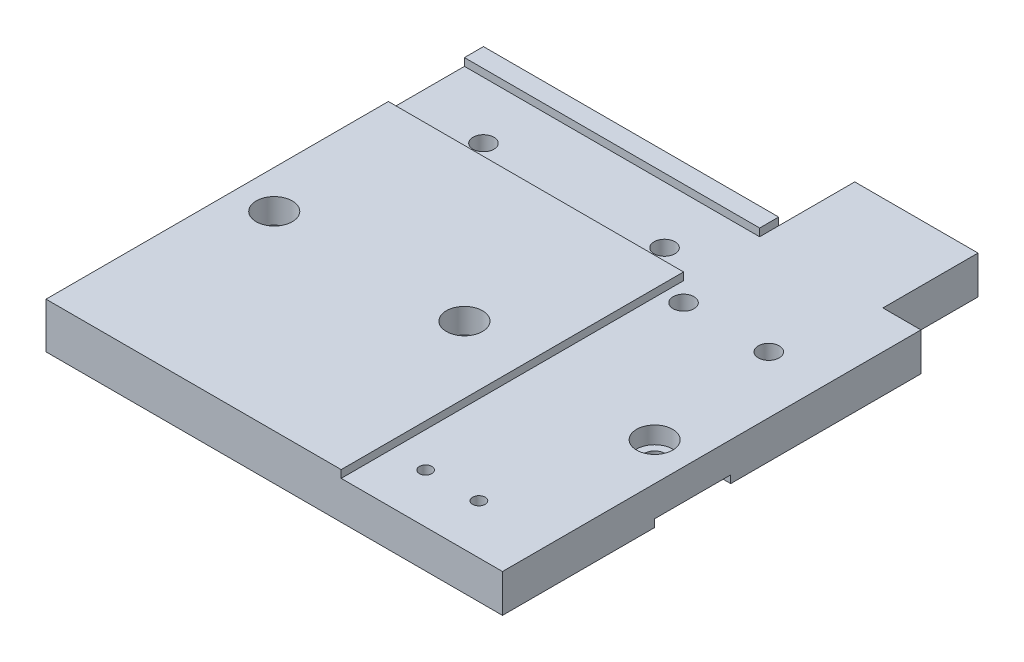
from build123d import *

# Parameters (mm, degrees)
EXTRUDE_1_DEPTH      = 135
SKETCH_3_OUTSIDE_W   = 158.204
SKETCH_3_OUTSIDE_H   = 173.204
SKETCH_3_OUTSIDE_R   = 2.75
SKETCH_3_OUTSIDE_R_2 = 1.65
CUT_EXTRUDE_1_DEPTH  = 135
SKETCH_4_R           = 4.75
CUT_EXTRUDE_2_DEPTH  = 6.5
SKETCH_5_OUTSIDE_W   = 173.204
SKETCH_5_OUTSIDE_H   = 50.204
CUT_EXTRUDE_3_DEPTH  = 182.022098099
SKETCH_7_W           = 77.6
SKETCH_7_H           = 20
CUT_EXTRUDE_4_DEPTH  = 2


with BuildPart() as part:
    # Sketch 2 → Extrude 1 (new body)
    with BuildSketch(Plane.XY):
        Polygon((120, 0), (120, 10), (77.6, 10), (77.6, 12), (0, 12), (0, 0), align=None)
    extrude(amount=EXTRUDE_1_DEPTH)

    # Sketch 3 outside → Cut-Extrude 1 (cut)
    # profile 1 of 10: a face of its own
    with BuildSketch(Plane(origin=(0, 12, 0), x_dir=(1, 0, 0), z_dir=(0, 1, 0))):
        with Locations((60, -67.5)):
            Rectangle(SKETCH_3_OUTSIDE_W, SKETCH_3_OUTSIDE_H)
        Polygon((0, -135), (120, -135), (120, -25), (110, -25), (110, 0), (77.6, 0), (77.6, -20), (0, -20), align=None, mode=Mode.SUBTRACT)
    # profile 2 of 10: a face of its own
    with BuildSketch(Plane(origin=(0, 12, 0), x_dir=(1, 0, 0), z_dir=(0, 1, 0))):
        with Locations(Location((20, -40, 0), (0, 0, 270))):
            Circle(SKETCH_3_OUTSIDE_R)
    # profile 3 of 10: a face of its own
    with BuildSketch(Plane(origin=(0, 12, 0), x_dir=(1, 0, 0), z_dir=(0, 1, 0))):
        with Locations(Location((67.6, -40, 0), (0, 0, 270))):
            Circle(SKETCH_3_OUTSIDE_R)
    # profile 4 of 10: a face of its own
    with BuildSketch(Plane(origin=(0, 12, 0), x_dir=(1, 0, 0), z_dir=(0, 1, 0))):
        with Locations(Location((105, -50, 0), (0, 0, 270))):
            Circle(SKETCH_3_OUTSIDE_R)
    # profile 5 of 10: a face of its own
    with BuildSketch(Plane(origin=(0, 12, 0), x_dir=(1, 0, 0), z_dir=(0, 1, 0))):
        with Locations(Location((82.6, -50, 0), (0, 0, 270))):
            Circle(SKETCH_3_OUTSIDE_R)
    # profile 6 of 10: a face of its own
    with BuildSketch(Plane(origin=(0, 12, 0), x_dir=(1, 0, 0), z_dir=(0, 1, 0))):
        with Locations(Location((86.8, -122, 0), (0, 0, 270))):
            Circle(SKETCH_3_OUTSIDE_R_2)
    # profile 7 of 10: a face of its own
    with BuildSketch(Plane(origin=(0, 12, 0), x_dir=(1, 0, 0), z_dir=(0, 1, 0))):
        with Locations(Location((100.8, -122, 0), (0, 0, 270))):
            Circle(SKETCH_3_OUTSIDE_R_2)
    # profile 8 of 10: a face of its own
    with BuildSketch(Plane(origin=(0, 12, 0), x_dir=(1, 0, 0), z_dir=(0, 1, 0))):
        with Locations(Location((10, -85, 0), (0, 0, 270))):
            Circle(SKETCH_3_OUTSIDE_R)
    # profile 9 of 10: a face of its own
    with BuildSketch(Plane(origin=(0, 12, 0), x_dir=(1, 0, 0), z_dir=(0, 1, 0))):
        with Locations(Location((60, -85, 0), (0, 0, 270))):
            Circle(SKETCH_3_OUTSIDE_R)
    # profile 10 of 10: a face of its own
    with BuildSketch(Plane(origin=(0, 12, 0), x_dir=(1, 0, 0), z_dir=(0, 1, 0))):
        with Locations(Location((110, -85, 0), (0, 0, 270))):
            Circle(SKETCH_3_OUTSIDE_R)
    extrude(amount=-CUT_EXTRUDE_1_DEPTH, mode=Mode.SUBTRACT)

    # Sketch 4 → Cut-Extrude 2 (cut)
    with BuildSketch(Plane(origin=(0, 12, 0), x_dir=(1, 0, 0), z_dir=(0, 1, 0))):
        with Locations(Location((10, -85, 0), (0, 0, 270))):
            Circle(SKETCH_4_R)
        with Locations(Location((60, -85, 0), (0, 0, 270))):
            Circle(SKETCH_4_R)
        with Locations(Location((110, -85, 0), (0, 0, 270))):
            Circle(SKETCH_4_R)
    extrude(amount=-CUT_EXTRUDE_2_DEPTH, mode=Mode.SUBTRACT)

    # Sketch 5 outside → Cut-Extrude 3 (cut, through all)
    with BuildSketch(Plane(origin=(120, 0, 0), x_dir=(0, 0, -1), z_dir=(1, 0, 0))):
        with Locations((-67.5, 6)):
            Rectangle(SKETCH_5_OUTSIDE_W, SKETCH_5_OUTSIDE_H)
        Polygon((0, 0), (0, 10), (-20, 10), (-20, 12), (-25, 12), (-45, 12), (-135, 12), (-135, 0), (-95, 0), (-95, 2), (-75, 2), (-75, 0), align=None, mode=Mode.SUBTRACT)
    extrude(amount=-CUT_EXTRUDE_3_DEPTH, mode=Mode.SUBTRACT)

    # Sketch 7 → Cut-Extrude 4 (cut)
    with BuildSketch(Plane(origin=(0, 12, 0), x_dir=(1, 0, 0), z_dir=(0, 1, 0))):
        with Locations((38.8, -35)):
            Rectangle(SKETCH_7_W, SKETCH_7_H)
    extrude(amount=-CUT_EXTRUDE_4_DEPTH, mode=Mode.SUBTRACT)


solid = part.part
